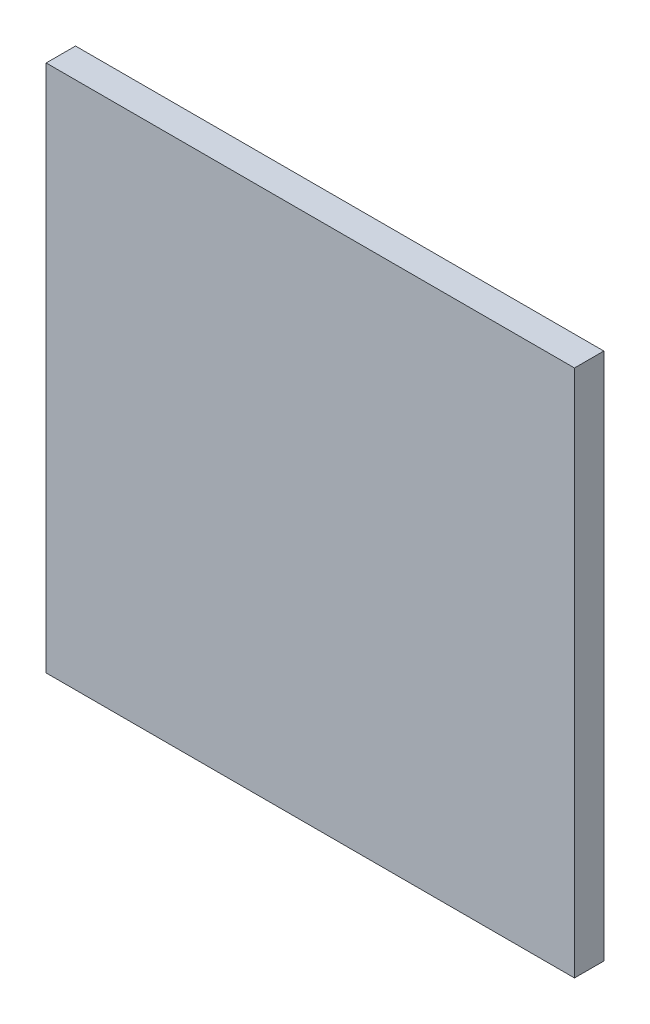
from build123d import *

# Parameters (mm, degrees)
SKETCH1_W           = 114.3
SKETCH1_H           = 114.3
BOSS_EXTRUDE1_DEPTH = 6.35


with BuildPart() as part:
    # Sketch1 → Boss-Extrude1 (new body)
    with BuildSketch(Plane.XY):
        Rectangle(SKETCH1_W, SKETCH1_H)
    extrude(amount=BOSS_EXTRUDE1_DEPTH)


solid = part.part
